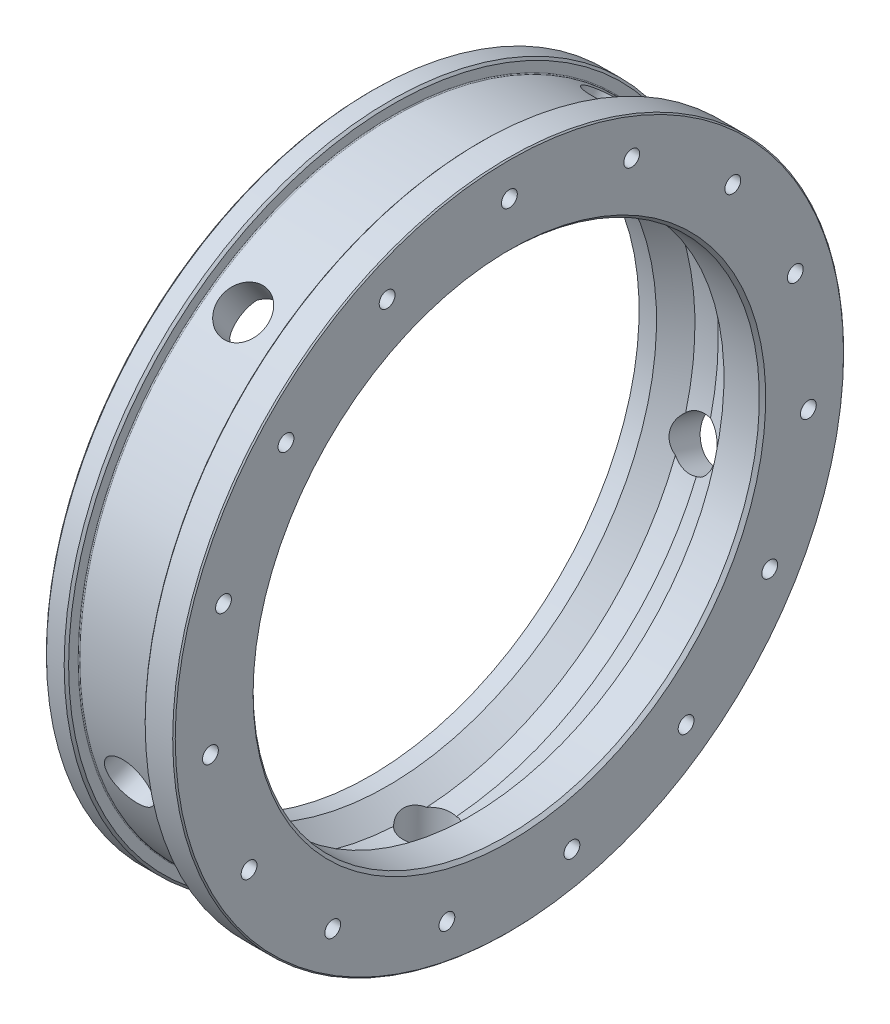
from build123d import *

# Parameters (mm, degrees)
CIRPATTERN1_COUNT  = 15
CHAMFER1_SIZE      = 0.7
CHAMFER2_SIZE      = 0.4
FILLET1_R          = 0.3
CHAMFER3_SIZE      = 1
SKETCH5_R          = 7.5
CUT_EXTRUDE1_DEPTH = 157.230598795
CIRPATTERN2_COUNT  = 5


with BuildPart() as part:
    # Sketch1 → Revolve1 (revolve)
    with BuildSketch(Plane.XY, mode=Mode.PRIVATE) as revolve1_sk:
        Polygon((0, 103), (0, 85), (5.5, 85), (12.640740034, 90), (20, 90), (31.8, 85.705151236), (31.8, 80), (44, 80), (44, 106), (34.5, 106), (34.5, 99), (7, 99), (7, 103), align=None)
    revolve(revolve1_sk.sketch.rotate(Axis((0, 0, 0), (1, 0, 0)), 90), axis=Axis((0, 0, 0), (1, 0, 0)))

    # Sketch3 → M6 Tapped Hole1 (revolve, cut)
    with BuildSketch(Plane(origin=(44, 95, 0), x_dir=(0, 0, -1), z_dir=(0, 1, 0))):
        Polygon((0, 0), (0, 13.502151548), (2.5, 12), (2.5, 0), align=None)
    m6_tapped_hole1 = revolve(axis=Axis((50.35, 95, 0), (-1, 0, 0)), mode=Mode.SUBTRACT)

    # CirPattern1: M6 Tapped Hole1 ×15 about axis
    cirpattern1_axis = Axis((0, 0, 0), (1, 0, 0))
    for i in range(1, CIRPATTERN1_COUNT):
        add(m6_tapped_hole1.rotate(cirpattern1_axis, i * 360 / CIRPATTERN1_COUNT), mode=Mode.SUBTRACT)

    # Chamfer1
    chamfer1_edges = [part.edges().sort_by_distance(p)[0] for p in [
        (7, 0, -103),
        (0, 0, -103),
    ]]
    chamfer(chamfer1_edges, length=CHAMFER1_SIZE)

    # Chamfer2
    chamfer2_edges = [part.edges().sort_by_distance(p)[0] for p in [
        (44, 0, -106),
        (34.5, 0, -106),
    ]]
    chamfer(chamfer2_edges, length=CHAMFER2_SIZE)

    # Fillet1
    fillet1_edges = [part.edges().sort_by_distance(p)[0] for p in [
        (34.5, 0, -99),
        (7, 0, -99),
    ]]
    fillet(fillet1_edges, radius=FILLET1_R)

    # Chamfer3
    chamfer3_edges = [part.edges().sort_by_distance(p)[0] for p in [
        (44, 0, -80),
    ]]
    chamfer(chamfer3_edges, length=CHAMFER3_SIZE)

    # Sketch5 → Cut-Extrude1 (cut, through all)
    with BuildSketch(Plane(origin=(0, 0, 0), x_dir=(1, 0, 0), z_dir=(0, 1, 0))):
        with Locations(Location((18, 0, 0), (0, 0, 270))):
            Circle(SKETCH5_R)
    cut_extrude1 = extrude(amount=-CUT_EXTRUDE1_DEPTH, mode=Mode.SUBTRACT)

    # CirPattern2: Cut-Extrude1 ×5 about axis
    cirpattern2_axis = Axis((44, 0, 0), (-1, 0, 0))
    for i in range(1, CIRPATTERN2_COUNT):
        add(cut_extrude1.rotate(cirpattern2_axis, i * 360 / CIRPATTERN2_COUNT), mode=Mode.SUBTRACT)


solid = part.part
